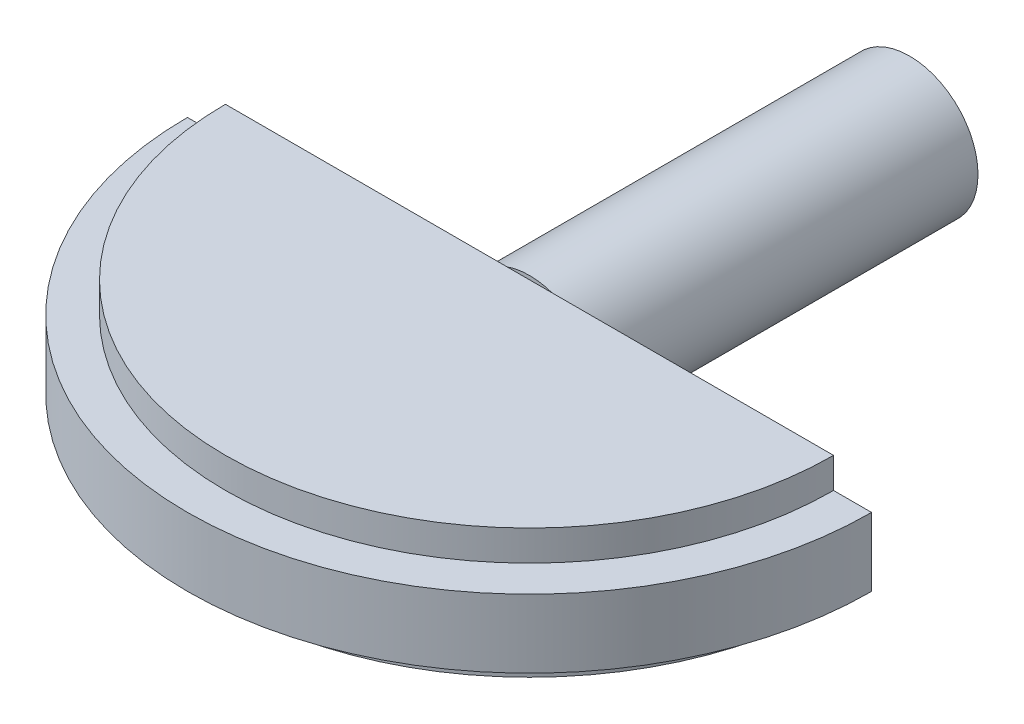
ISO-10303-21;
HEADER;
FILE_DESCRIPTION(('STEP AP214'),'2;1');
FILE_NAME('part.step','',(''),(''),'','','');
FILE_SCHEMA(('AUTOMOTIVE_DESIGN { 1 0 10303 214 1 1 1 1 }'));
ENDSEC;
DATA;
#1=APPLICATION_CONTEXT('core data for automotive mechanical design processes');
#2=APPLICATION_PROTOCOL_DEFINITION('international standard','automotive_design',2000,#1);
#3=PRODUCT_CONTEXT('',#1,'mechanical');
#4=PRODUCT('Part','Part','',(#3));
#5=PRODUCT_RELATED_PRODUCT_CATEGORY('part','',(#4));
#6=PRODUCT_DEFINITION_FORMATION('','',#4);
#7=PRODUCT_DEFINITION_CONTEXT('part definition',#1,'design');
#8=PRODUCT_DEFINITION('design','',#6,#7);
#9=PRODUCT_DEFINITION_SHAPE('','',#8);
#10=(LENGTH_UNIT() NAMED_UNIT(*) SI_UNIT(.MILLI.,.METRE.));
#11=(NAMED_UNIT(*) PLANE_ANGLE_UNIT() SI_UNIT($,.RADIAN.));
#12=(NAMED_UNIT(*) SI_UNIT($,.STERADIAN.) SOLID_ANGLE_UNIT());
#13=UNCERTAINTY_MEASURE_WITH_UNIT(LENGTH_MEASURE(1.E-05),#10,'distance_accuracy_value','');
#14=(GEOMETRIC_REPRESENTATION_CONTEXT(3) GLOBAL_UNCERTAINTY_ASSIGNED_CONTEXT((#13)) GLOBAL_UNIT_ASSIGNED_CONTEXT((#10,
#11,#12)) REPRESENTATION_CONTEXT('',''));
#15=CARTESIAN_POINT('',(0.,0.,0.));
#16=DIRECTION('',(0.,0.,1.));
#17=DIRECTION('',(1.,0.,0.));
#18=AXIS2_PLACEMENT_3D('',#15,#16,#17);
#19=CARTESIAN_POINT('',(0.,0.,50.));
#20=DIRECTION('',(0.,0.,1.));
#21=DIRECTION('',(1.,0.,0.));
#22=AXIS2_PLACEMENT_3D('',#19,#20,#21);
#23=PLANE('',#22);
#24=CARTESIAN_POINT('',(0.,0.,50.));
#25=DIRECTION('',(0.,0.,1.));
#26=DIRECTION('',(1.,0.,0.));
#27=AXIS2_PLACEMENT_3D('',#24,#25,#26);
#28=CIRCLE('',#27,9.);
#29=CARTESIAN_POINT('',(-2.9580398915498,-8.5,50.));
#30=VERTEX_POINT('',#29);
#31=CARTESIAN_POINT('',(2.9580398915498,-8.5,50.));
#32=VERTEX_POINT('',#31);
#33=EDGE_CURVE('E150',#30,#32,#28,.T.);
#34=ORIENTED_EDGE('',*,*,#33,.T.);
#35=DIRECTION('',(-1.,0.,0.));
#36=VECTOR('',#35,1.);
#37=CARTESIAN_POINT('',(0.,-8.5,50.));
#38=LINE('',#37,#36);
#39=EDGE_CURVE('E86',#32,#30,#38,.T.);
#40=ORIENTED_EDGE('',*,*,#39,.T.);
#41=EDGE_LOOP('',(#34,#40));
#42=FACE_BOUND('',#41,.T.);
#43=ADVANCED_FACE('F14',(#42),#23,.T.);
#44=CARTESIAN_POINT('',(2.9580398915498,8.5,50.));
#45=VERTEX_POINT('',#44);
#46=CARTESIAN_POINT('',(-2.9580398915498,8.5,50.));
#47=VERTEX_POINT('',#46);
#48=EDGE_CURVE('E9',#45,#47,#28,.T.);
#49=ORIENTED_EDGE('',*,*,#48,.T.);
#50=DIRECTION('',(1.,0.,0.));
#51=VECTOR('',#50,1.);
#52=CARTESIAN_POINT('',(0.,8.5,50.));
#53=LINE('',#52,#51);
#54=EDGE_CURVE('E134',#47,#45,#53,.T.);
#55=ORIENTED_EDGE('',*,*,#54,.T.);
#56=EDGE_LOOP('',(#49,#55));
#57=FACE_BOUND('',#56,.T.);
#58=ADVANCED_FACE('F165',(#57),#23,.T.);
#59=CARTESIAN_POINT('',(0.,0.,50.));
#60=DIRECTION('',(0.,0.,-1.));
#61=DIRECTION('',(-1.,0.,0.));
#62=AXIS2_PLACEMENT_3D('',#59,#60,#61);
#63=CYLINDRICAL_SURFACE('',#62,9.);
#64=ORIENTED_EDGE('',*,*,#48,.F.);
#65=EDGE_CURVE('E24',#32,#45,#28,.T.);
#66=ORIENTED_EDGE('',*,*,#65,.F.);
#67=ORIENTED_EDGE('',*,*,#33,.F.);
#68=EDGE_CURVE('E23',#47,#30,#28,.T.);
#69=ORIENTED_EDGE('',*,*,#68,.F.);
#70=EDGE_LOOP('',(#64,#66,#67,#69));
#71=FACE_BOUND('',#70,.T.);
#72=CARTESIAN_POINT('',(0.,0.,0.));
#73=DIRECTION('',(0.,0.,1.));
#74=DIRECTION('',(1.,0.,0.));
#75=AXIS2_PLACEMENT_3D('',#72,#73,#74);
#76=CIRCLE('',#75,9.);
#77=CARTESIAN_POINT('',(9.,0.,0.));
#78=VERTEX_POINT('',#77);
#79=EDGE_CURVE('E18',#78,#78,#76,.T.);
#80=ORIENTED_EDGE('',*,*,#79,.T.);
#81=EDGE_LOOP('',(#80));
#82=FACE_BOUND('',#81,.T.);
#83=ADVANCED_FACE('F16',(#71,#82),#63,.T.);
#84=CARTESIAN_POINT('',(0.,0.,0.));
#85=DIRECTION('',(0.,0.,1.));
#86=DIRECTION('',(1.,0.,0.));
#87=AXIS2_PLACEMENT_3D('',#84,#85,#86);
#88=PLANE('',#87);
#89=ORIENTED_EDGE('',*,*,#79,.F.);
#90=EDGE_LOOP('',(#89));
#91=FACE_BOUND('',#90,.T.);
#92=ADVANCED_FACE('F156',(#91),#88,.F.);
#93=CARTESIAN_POINT('',(0.,-8.5,50.));
#94=DIRECTION('',(0.,0.,-1.));
#95=DIRECTION('',(-1.,0.,0.));
#96=AXIS2_PLACEMENT_3D('',#93,#94,#95);
#97=PLANE('',#96);
#98=ORIENTED_EDGE('',*,*,#65,.T.);
#99=CARTESIAN_POINT('',(40.,8.5,50.));
#100=VERTEX_POINT('',#99);
#101=EDGE_CURVE('E129',#45,#100,#53,.T.);
#102=ORIENTED_EDGE('',*,*,#101,.T.);
#103=DIRECTION('',(0.,1.,0.));
#104=VECTOR('',#103,1.);
#105=CARTESIAN_POINT('',(40.,8.5,50.));
#106=LINE('',#105,#104);
#107=CARTESIAN_POINT('',(40.,4.5,50.));
#108=VERTEX_POINT('',#107);
#109=EDGE_CURVE('E113',#108,#100,#106,.T.);
#110=ORIENTED_EDGE('',*,*,#109,.F.);
#111=DIRECTION('',(-1.,0.,0.));
#112=VECTOR('',#111,1.);
#113=CARTESIAN_POINT('',(40.,4.5,50.));
#114=LINE('',#113,#112);
#115=CARTESIAN_POINT('',(45.,4.5,50.));
#116=VERTEX_POINT('',#115);
#117=EDGE_CURVE('E110',#116,#108,#114,.T.);
#118=ORIENTED_EDGE('',*,*,#117,.F.);
#119=DIRECTION('',(0.,1.,0.));
#120=VECTOR('',#119,1.);
#121=CARTESIAN_POINT('',(45.,4.5,50.));
#122=LINE('',#121,#120);
#123=CARTESIAN_POINT('',(45.,-4.5,50.));
#124=VERTEX_POINT('',#123);
#125=EDGE_CURVE('E105',#124,#116,#122,.T.);
#126=ORIENTED_EDGE('',*,*,#125,.F.);
#127=DIRECTION('',(1.,0.,0.));
#128=VECTOR('',#127,1.);
#129=CARTESIAN_POINT('',(40.,-4.5,50.));
#130=LINE('',#129,#128);
#131=CARTESIAN_POINT('',(40.,-4.5,50.));
#132=VERTEX_POINT('',#131);
#133=EDGE_CURVE('E103',#132,#124,#130,.T.);
#134=ORIENTED_EDGE('',*,*,#133,.F.);
#135=DIRECTION('',(0.,1.,0.));
#136=VECTOR('',#135,1.);
#137=CARTESIAN_POINT('',(40.,-4.5,50.));
#138=LINE('',#137,#136);
#139=CARTESIAN_POINT('',(40.,-8.5,50.));
#140=VERTEX_POINT('',#139);
#141=EDGE_CURVE('E95',#140,#132,#138,.T.);
#142=ORIENTED_EDGE('',*,*,#141,.F.);
#143=EDGE_CURVE('E79',#140,#32,#38,.T.);
#144=ORIENTED_EDGE('',*,*,#143,.T.);
#145=EDGE_LOOP('',(#98,#102,#110,#118,#126,#134,#142,#144));
#146=FACE_BOUND('',#145,.T.);
#147=ADVANCED_FACE('F100',(#146),#97,.T.);
#148=ORIENTED_EDGE('',*,*,#68,.T.);
#149=CARTESIAN_POINT('',(-40.,-8.5,50.));
#150=VERTEX_POINT('',#149);
#151=EDGE_CURVE('E91',#30,#150,#38,.T.);
#152=ORIENTED_EDGE('',*,*,#151,.T.);
#153=DIRECTION('',(0.,1.,0.));
#154=VECTOR('',#153,1.);
#155=CARTESIAN_POINT('',(-40.,-4.5,50.));
#156=LINE('',#155,#154);
#157=CARTESIAN_POINT('',(-40.,-4.5,50.));
#158=VERTEX_POINT('',#157);
#159=EDGE_CURVE('E89',#150,#158,#156,.T.);
#160=ORIENTED_EDGE('',*,*,#159,.T.);
#161=DIRECTION('',(-1.,0.,0.));
#162=VECTOR('',#161,1.);
#163=CARTESIAN_POINT('',(-40.,-4.5,50.));
#164=LINE('',#163,#162);
#165=CARTESIAN_POINT('',(-45.,-4.5,50.));
#166=VERTEX_POINT('',#165);
#167=EDGE_CURVE('E117',#158,#166,#164,.T.);
#168=ORIENTED_EDGE('',*,*,#167,.T.);
#169=DIRECTION('',(0.,1.,0.));
#170=VECTOR('',#169,1.);
#171=CARTESIAN_POINT('',(-45.,4.5,50.));
#172=LINE('',#171,#170);
#173=CARTESIAN_POINT('',(-45.,4.5,50.));
#174=VERTEX_POINT('',#173);
#175=EDGE_CURVE('E120',#166,#174,#172,.T.);
#176=ORIENTED_EDGE('',*,*,#175,.T.);
#177=DIRECTION('',(1.,0.,0.));
#178=VECTOR('',#177,1.);
#179=CARTESIAN_POINT('',(-40.,4.5,50.));
#180=LINE('',#179,#178);
#181=CARTESIAN_POINT('',(-40.,4.5,50.));
#182=VERTEX_POINT('',#181);
#183=EDGE_CURVE('E123',#174,#182,#180,.T.);
#184=ORIENTED_EDGE('',*,*,#183,.T.);
#185=DIRECTION('',(0.,1.,0.));
#186=VECTOR('',#185,1.);
#187=CARTESIAN_POINT('',(-40.,8.5,50.));
#188=LINE('',#187,#186);
#189=CARTESIAN_POINT('',(-40.,8.5,50.));
#190=VERTEX_POINT('',#189);
#191=EDGE_CURVE('E126',#182,#190,#188,.T.);
#192=ORIENTED_EDGE('',*,*,#191,.T.);
#193=EDGE_CURVE('E130',#190,#47,#53,.T.);
#194=ORIENTED_EDGE('',*,*,#193,.T.);
#195=EDGE_LOOP('',(#148,#152,#160,#168,#176,#184,#192,#194));
#196=FACE_BOUND('',#195,.T.);
#197=ADVANCED_FACE('F147',(#196),#97,.T.);
#198=CARTESIAN_POINT('',(0.,-8.5,50.));
#199=DIRECTION('',(0.,1.,0.));
#200=DIRECTION('',(0.,0.,1.));
#201=AXIS2_PLACEMENT_3D('',#198,#199,#200);
#202=PLANE('',#201);
#203=CARTESIAN_POINT('',(0.,-8.5,50.));
#204=DIRECTION('',(0.,1.,0.));
#205=DIRECTION('',(0.,0.,1.));
#206=AXIS2_PLACEMENT_3D('',#203,#204,#205);
#207=CIRCLE('',#206,40.);
#208=EDGE_CURVE('E83',#150,#140,#207,.T.);
#209=ORIENTED_EDGE('',*,*,#208,.F.);
#210=ORIENTED_EDGE('',*,*,#151,.F.);
#211=ORIENTED_EDGE('',*,*,#39,.F.);
#212=ORIENTED_EDGE('',*,*,#143,.F.);
#213=EDGE_LOOP('',(#209,#210,#211,#212));
#214=FACE_BOUND('',#213,.T.);
#215=ADVANCED_FACE('F81',(#214),#202,.F.);
#216=CARTESIAN_POINT('',(0.,9.,50.));
#217=DIRECTION('',(0.,1.,0.));
#218=DIRECTION('',(0.,0.,1.));
#219=AXIS2_PLACEMENT_3D('',#216,#217,#218);
#220=CYLINDRICAL_SURFACE('',#219,40.);
#221=CARTESIAN_POINT('',(0.,-4.5,50.));
#222=DIRECTION('',(0.,1.,0.));
#223=DIRECTION('',(0.,0.,1.));
#224=AXIS2_PLACEMENT_3D('',#221,#222,#223);
#225=CIRCLE('',#224,40.);
#226=EDGE_CURVE('E98',#158,#132,#225,.T.);
#227=ORIENTED_EDGE('',*,*,#226,.F.);
#228=ORIENTED_EDGE('',*,*,#159,.F.);
#229=ORIENTED_EDGE('',*,*,#208,.T.);
#230=ORIENTED_EDGE('',*,*,#141,.T.);
#231=EDGE_LOOP('',(#227,#228,#229,#230));
#232=FACE_BOUND('',#231,.T.);
#233=ADVANCED_FACE('F94',(#232),#220,.T.);
#234=CARTESIAN_POINT('',(-40.,-4.5,50.));
#235=DIRECTION('',(0.,1.,0.));
#236=DIRECTION('',(0.,0.,1.));
#237=AXIS2_PLACEMENT_3D('',#234,#235,#236);
#238=PLANE('',#237);
#239=CARTESIAN_POINT('',(0.,-4.5,50.));
#240=DIRECTION('',(0.,1.,0.));
#241=DIRECTION('',(0.,0.,1.));
#242=AXIS2_PLACEMENT_3D('',#239,#240,#241);
#243=CIRCLE('',#242,45.);
#244=EDGE_CURVE('E141',#166,#124,#243,.T.);
#245=ORIENTED_EDGE('',*,*,#244,.F.);
#246=ORIENTED_EDGE('',*,*,#167,.F.);
#247=ORIENTED_EDGE('',*,*,#226,.T.);
#248=ORIENTED_EDGE('',*,*,#133,.T.);
#249=EDGE_LOOP('',(#245,#246,#247,#248));
#250=FACE_BOUND('',#249,.T.);
#251=ADVANCED_FACE('F145',(#250),#238,.F.);
#252=CARTESIAN_POINT('',(0.,9.,50.));
#253=DIRECTION('',(0.,1.,0.));
#254=DIRECTION('',(0.,0.,1.));
#255=AXIS2_PLACEMENT_3D('',#252,#253,#254);
#256=CYLINDRICAL_SURFACE('',#255,45.);
#257=CARTESIAN_POINT('',(0.,4.5,50.));
#258=DIRECTION('',(0.,1.,0.));
#259=DIRECTION('',(0.,0.,1.));
#260=AXIS2_PLACEMENT_3D('',#257,#258,#259);
#261=CIRCLE('',#260,45.);
#262=EDGE_CURVE('E139',#174,#116,#261,.T.);
#263=ORIENTED_EDGE('',*,*,#262,.F.);
#264=ORIENTED_EDGE('',*,*,#175,.F.);
#265=ORIENTED_EDGE('',*,*,#244,.T.);
#266=ORIENTED_EDGE('',*,*,#125,.T.);
#267=EDGE_LOOP('',(#263,#264,#265,#266));
#268=FACE_BOUND('',#267,.T.);
#269=ADVANCED_FACE('F180',(#268),#256,.T.);
#270=CARTESIAN_POINT('',(-40.,4.5,50.));
#271=DIRECTION('',(0.,-1.,0.));
#272=DIRECTION('',(0.,0.,-1.));
#273=AXIS2_PLACEMENT_3D('',#270,#271,#272);
#274=PLANE('',#273);
#275=CARTESIAN_POINT('',(0.,4.5,50.));
#276=DIRECTION('',(0.,1.,0.));
#277=DIRECTION('',(0.,0.,1.));
#278=AXIS2_PLACEMENT_3D('',#275,#276,#277);
#279=CIRCLE('',#278,40.);
#280=EDGE_CURVE('E137',#182,#108,#279,.T.);
#281=ORIENTED_EDGE('',*,*,#280,.F.);
#282=ORIENTED_EDGE('',*,*,#183,.F.);
#283=ORIENTED_EDGE('',*,*,#262,.T.);
#284=ORIENTED_EDGE('',*,*,#117,.T.);
#285=EDGE_LOOP('',(#281,#282,#283,#284));
#286=FACE_BOUND('',#285,.T.);
#287=ADVANCED_FACE('F183',(#286),#274,.F.);
#288=CARTESIAN_POINT('',(0.,9.,50.));
#289=DIRECTION('',(0.,1.,0.));
#290=DIRECTION('',(0.,0.,1.));
#291=AXIS2_PLACEMENT_3D('',#288,#289,#290);
#292=CYLINDRICAL_SURFACE('',#291,40.);
#293=CARTESIAN_POINT('',(0.,8.5,50.));
#294=DIRECTION('',(0.,1.,0.));
#295=DIRECTION('',(0.,0.,1.));
#296=AXIS2_PLACEMENT_3D('',#293,#294,#295);
#297=CIRCLE('',#296,40.);
#298=EDGE_CURVE('E133',#190,#100,#297,.T.);
#299=ORIENTED_EDGE('',*,*,#298,.F.);
#300=ORIENTED_EDGE('',*,*,#191,.F.);
#301=ORIENTED_EDGE('',*,*,#280,.T.);
#302=ORIENTED_EDGE('',*,*,#109,.T.);
#303=EDGE_LOOP('',(#299,#300,#301,#302));
#304=FACE_BOUND('',#303,.T.);
#305=ADVANCED_FACE('F187',(#304),#292,.T.);
#306=CARTESIAN_POINT('',(0.,8.5,50.));
#307=DIRECTION('',(0.,-1.,0.));
#308=DIRECTION('',(0.,0.,-1.));
#309=AXIS2_PLACEMENT_3D('',#306,#307,#308);
#310=PLANE('',#309);
#311=ORIENTED_EDGE('',*,*,#193,.F.);
#312=ORIENTED_EDGE('',*,*,#298,.T.);
#313=ORIENTED_EDGE('',*,*,#101,.F.);
#314=ORIENTED_EDGE('',*,*,#54,.F.);
#315=EDGE_LOOP('',(#311,#312,#313,#314));
#316=FACE_BOUND('',#315,.T.);
#317=ADVANCED_FACE('F191',(#316),#310,.F.);
#318=CLOSED_SHELL('',(#43,#58,#83,#92,#147,#197,#215,#233,#251,#269,#287,#305,#317));
#319=MANIFOLD_SOLID_BREP('B1',#318);
#320=ADVANCED_BREP_SHAPE_REPRESENTATION('',(#18,#319),#14);
#321=SHAPE_DEFINITION_REPRESENTATION(#9,#320);
ENDSEC;
END-ISO-10303-21;
